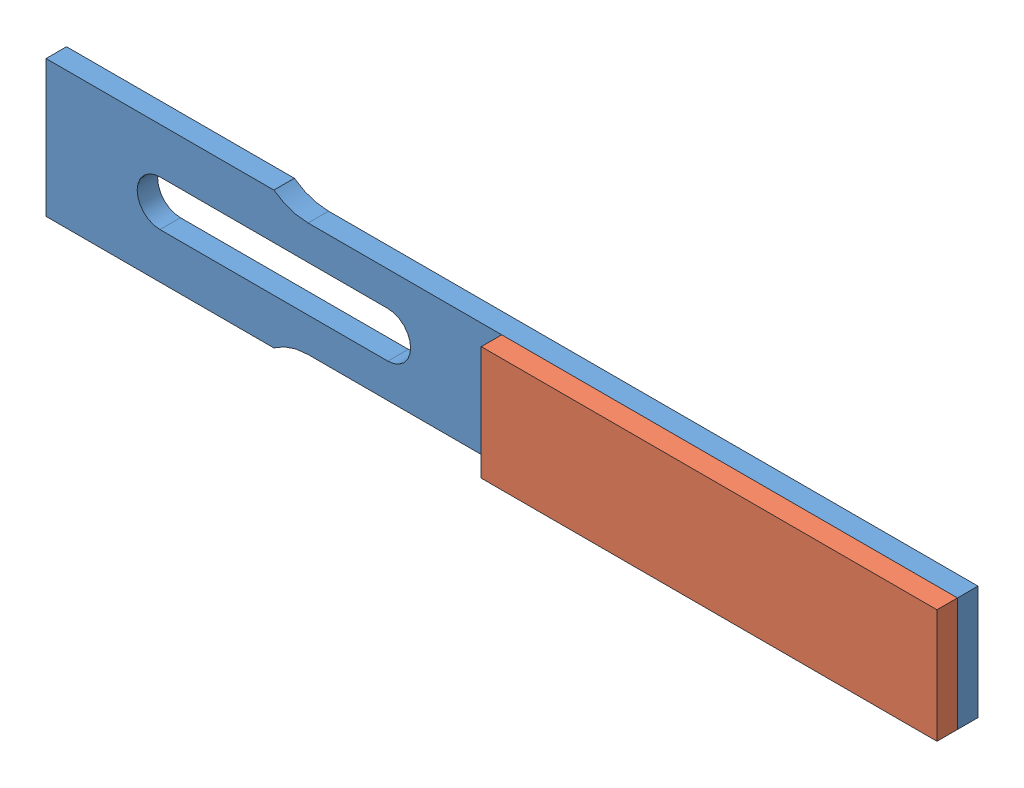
SolidWorks assembly BIMETAL PLATE.SLDASM, configuration Default (file format 4400). Lengths in mm.
Overall size (80 12 3.6).
2 component instances, 2 part files, 3 mates.
Components (placement in the parent):
- B01-1: B01.SLDPRT [Default] at origin size (80 12 1.8)
- B02-2: B02.SLDPRT [Default] at (40 0 1.8) size (40 10 1.8)
Mates (geometry in assembly coordinates):
- Coincident6: coincident anti-aligned: plane of B01-1 through (23 10 1.8) normal (0 0 1); plane of B02-2 through (40 5 1.8) normal (0 0 -1)
- Coincident7: coincident aligned: plane of B01-1 through (80 -5 1.8) normal (0 -1 0); plane of B02-2 through (40 -5 3.6) normal (0 -1 0)
- Coincident9: coincident aligned: plane of B01-1 through (80 -5 1.8) normal (1 0 0); plane of B02-2 through (80 5 3.6) normal (1 0 0)
